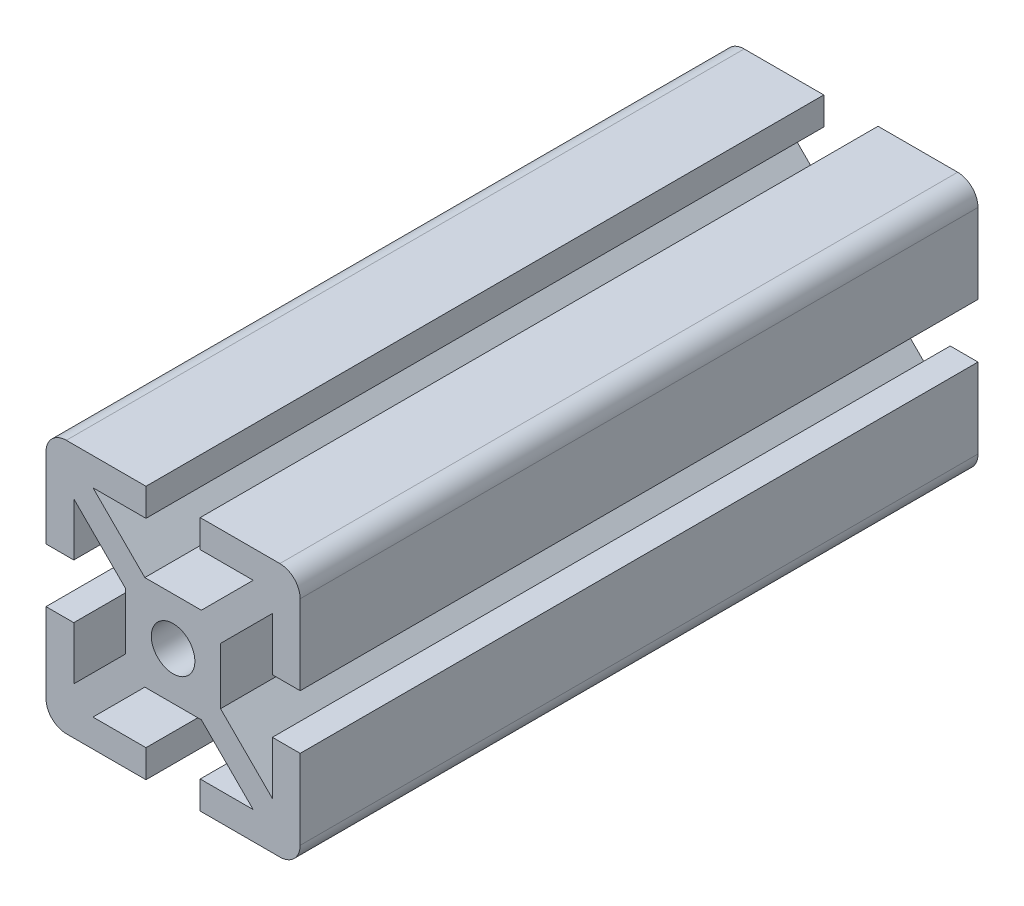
ISO-10303-21;
HEADER;
FILE_DESCRIPTION(('STEP AP214'),'2;1');
FILE_NAME('part.step','',(''),(''),'','','');
FILE_SCHEMA(('AUTOMOTIVE_DESIGN { 1 0 10303 214 1 1 1 1 }'));
ENDSEC;
DATA;
#1=APPLICATION_CONTEXT('core data for automotive mechanical design processes');
#2=APPLICATION_PROTOCOL_DEFINITION('international standard','automotive_design',2000,#1);
#3=PRODUCT_CONTEXT('',#1,'mechanical');
#4=PRODUCT('Part','Part','',(#3));
#5=PRODUCT_RELATED_PRODUCT_CATEGORY('part','',(#4));
#6=PRODUCT_DEFINITION_FORMATION('','',#4);
#7=PRODUCT_DEFINITION_CONTEXT('part definition',#1,'design');
#8=PRODUCT_DEFINITION('design','',#6,#7);
#9=PRODUCT_DEFINITION_SHAPE('','',#8);
#10=(LENGTH_UNIT() NAMED_UNIT(*) SI_UNIT(.MILLI.,.METRE.));
#11=(NAMED_UNIT(*) PLANE_ANGLE_UNIT() SI_UNIT($,.RADIAN.));
#12=(NAMED_UNIT(*) SI_UNIT($,.STERADIAN.) SOLID_ANGLE_UNIT());
#13=UNCERTAINTY_MEASURE_WITH_UNIT(LENGTH_MEASURE(1.E-05),#10,'distance_accuracy_value','');
#14=(GEOMETRIC_REPRESENTATION_CONTEXT(3) GLOBAL_UNCERTAINTY_ASSIGNED_CONTEXT((#13)) GLOBAL_UNIT_ASSIGNED_CONTEXT((#10,
#11,#12)) REPRESENTATION_CONTEXT('',''));
#15=CARTESIAN_POINT('',(0.,0.,0.));
#16=DIRECTION('',(0.,0.,1.));
#17=DIRECTION('',(1.,0.,0.));
#18=AXIS2_PLACEMENT_3D('',#15,#16,#17);
#19=CARTESIAN_POINT('',(-7.11199999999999,0.,-101.6));
#20=DIRECTION('',(-1.,0.,0.));
#21=DIRECTION('',(0.,-1.,0.));
#22=AXIS2_PLACEMENT_3D('',#19,#20,#21);
#23=PLANE('',#22);
#24=DIRECTION('',(0.,-1.,0.));
#25=VECTOR('',#24,1.);
#26=CARTESIAN_POINT('',(-7.11199999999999,0.,0.));
#27=LINE('',#26,#25);
#28=CARTESIAN_POINT('',(-7.11199999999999,4.23831804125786,0.));
#29=VERTEX_POINT('',#28);
#30=CARTESIAN_POINT('',(-7.11199999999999,-4.23831804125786,0.));
#31=VERTEX_POINT('',#30);
#32=EDGE_CURVE('E438',#29,#31,#27,.T.);
#33=ORIENTED_EDGE('',*,*,#32,.F.);
#34=DIRECTION('',(0.,0.,1.));
#35=VECTOR('',#34,1.);
#36=CARTESIAN_POINT('',(-7.11199999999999,4.23831804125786,-101.6));
#37=LINE('',#36,#35);
#38=CARTESIAN_POINT('',(-7.11199999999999,4.23831804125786,-101.6));
#39=VERTEX_POINT('',#38);
#40=EDGE_CURVE('E11',#39,#29,#37,.T.);
#41=ORIENTED_EDGE('',*,*,#40,.F.);
#42=DIRECTION('',(0.,-1.,0.));
#43=VECTOR('',#42,1.);
#44=CARTESIAN_POINT('',(-7.11199999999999,0.,-101.6));
#45=LINE('',#44,#43);
#46=CARTESIAN_POINT('',(-7.11199999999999,-4.23831804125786,-101.6));
#47=VERTEX_POINT('',#46);
#48=EDGE_CURVE('E52',#39,#47,#45,.T.);
#49=ORIENTED_EDGE('',*,*,#48,.T.);
#50=DIRECTION('',(0.,0.,1.));
#51=VECTOR('',#50,1.);
#52=CARTESIAN_POINT('',(-7.11199999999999,-4.23831804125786,-101.6));
#53=LINE('',#52,#51);
#54=EDGE_CURVE('E37',#47,#31,#53,.T.);
#55=ORIENTED_EDGE('',*,*,#54,.T.);
#56=EDGE_LOOP('',(#33,#41,#49,#55));
#57=FACE_BOUND('',#56,.T.);
#58=ADVANCED_FACE('F33',(#57),#23,.T.);
#59=CARTESIAN_POINT('',(-7.11199999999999,4.23831804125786,-101.6));
#60=DIRECTION('',(-0.707106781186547,-0.707106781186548,0.));
#61=DIRECTION('',(0.707106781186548,-0.707106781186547,0.));
#62=AXIS2_PLACEMENT_3D('',#59,#60,#61);
#63=PLANE('',#62);
#64=DIRECTION('',(0.707106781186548,-0.707106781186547,0.));
#65=VECTOR('',#64,1.);
#66=CARTESIAN_POINT('',(-7.11199999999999,4.23831804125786,0.));
#67=LINE('',#66,#65);
#68=CARTESIAN_POINT('',(-14.8844,12.0107180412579,0.));
#69=VERTEX_POINT('',#68);
#70=EDGE_CURVE('E436',#69,#29,#67,.T.);
#71=ORIENTED_EDGE('',*,*,#70,.F.);
#72=DIRECTION('',(0.,0.,1.));
#73=VECTOR('',#72,1.);
#74=CARTESIAN_POINT('',(-14.8844,12.0107180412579,-101.6));
#75=LINE('',#74,#73);
#76=CARTESIAN_POINT('',(-14.8844,12.0107180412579,-101.6));
#77=VERTEX_POINT('',#76);
#78=EDGE_CURVE('E43',#77,#69,#75,.T.);
#79=ORIENTED_EDGE('',*,*,#78,.F.);
#80=DIRECTION('',(0.707106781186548,-0.707106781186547,0.));
#81=VECTOR('',#80,1.);
#82=CARTESIAN_POINT('',(-7.11199999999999,4.23831804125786,-101.6));
#83=LINE('',#82,#81);
#84=EDGE_CURVE('E314',#77,#39,#83,.T.);
#85=ORIENTED_EDGE('',*,*,#84,.T.);
#86=ORIENTED_EDGE('',*,*,#40,.T.);
#87=EDGE_LOOP('',(#71,#79,#85,#86));
#88=FACE_BOUND('',#87,.T.);
#89=ADVANCED_FACE('F518',(#88),#63,.T.);
#90=CARTESIAN_POINT('',(-14.8844,12.0107180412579,-101.6));
#91=DIRECTION('',(1.,0.,0.));
#92=DIRECTION('',(0.,1.,0.));
#93=AXIS2_PLACEMENT_3D('',#90,#91,#92);
#94=PLANE('',#93);
#95=DIRECTION('',(0.,1.,0.));
#96=VECTOR('',#95,1.);
#97=CARTESIAN_POINT('',(-14.8844,12.0107180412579,0.));
#98=LINE('',#97,#96);
#99=CARTESIAN_POINT('',(-14.8844,4.06400000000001,0.));
#100=VERTEX_POINT('',#99);
#101=EDGE_CURVE('E302',#100,#69,#98,.T.);
#102=ORIENTED_EDGE('',*,*,#101,.F.);
#103=DIRECTION('',(0.,0.,1.));
#104=VECTOR('',#103,1.);
#105=CARTESIAN_POINT('',(-14.8844,4.06400000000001,-101.6));
#106=LINE('',#105,#104);
#107=CARTESIAN_POINT('',(-14.8844,4.06400000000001,-101.6));
#108=VERTEX_POINT('',#107);
#109=EDGE_CURVE('E297',#108,#100,#106,.T.);
#110=ORIENTED_EDGE('',*,*,#109,.F.);
#111=DIRECTION('',(0.,1.,0.));
#112=VECTOR('',#111,1.);
#113=CARTESIAN_POINT('',(-14.8844,12.0107180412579,-101.6));
#114=LINE('',#113,#112);
#115=EDGE_CURVE('E300',#108,#77,#114,.T.);
#116=ORIENTED_EDGE('',*,*,#115,.T.);
#117=ORIENTED_EDGE('',*,*,#78,.T.);
#118=EDGE_LOOP('',(#102,#110,#116,#117));
#119=FACE_BOUND('',#118,.T.);
#120=ADVANCED_FACE('F299',(#119),#94,.T.);
#121=CARTESIAN_POINT('',(-14.8844,4.06400000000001,-101.6));
#122=DIRECTION('',(0.,-1.,0.));
#123=DIRECTION('',(1.,0.,0.));
#124=AXIS2_PLACEMENT_3D('',#121,#122,#123);
#125=PLANE('',#124);
#126=DIRECTION('',(1.,0.,0.));
#127=VECTOR('',#126,1.);
#128=CARTESIAN_POINT('',(-14.8844,4.06400000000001,0.));
#129=LINE('',#128,#127);
#130=CARTESIAN_POINT('',(-19.05,4.064,0.));
#131=VERTEX_POINT('',#130);
#132=EDGE_CURVE('E433',#131,#100,#129,.T.);
#133=ORIENTED_EDGE('',*,*,#132,.F.);
#134=DIRECTION('',(0.,0.,1.));
#135=VECTOR('',#134,1.);
#136=CARTESIAN_POINT('',(-19.05,4.064,-101.6));
#137=LINE('',#136,#135);
#138=CARTESIAN_POINT('',(-19.05,4.064,-101.6));
#139=VERTEX_POINT('',#138);
#140=EDGE_CURVE('E307',#139,#131,#137,.T.);
#141=ORIENTED_EDGE('',*,*,#140,.F.);
#142=DIRECTION('',(1.,0.,0.));
#143=VECTOR('',#142,1.);
#144=CARTESIAN_POINT('',(-14.8844,4.06400000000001,-101.6));
#145=LINE('',#144,#143);
#146=EDGE_CURVE('E312',#139,#108,#145,.T.);
#147=ORIENTED_EDGE('',*,*,#146,.T.);
#148=ORIENTED_EDGE('',*,*,#109,.T.);
#149=EDGE_LOOP('',(#133,#141,#147,#148));
#150=FACE_BOUND('',#149,.T.);
#151=ADVANCED_FACE('F316',(#150),#125,.T.);
#152=CARTESIAN_POINT('',(-19.05,4.064,-101.6));
#153=DIRECTION('',(-1.,0.,0.));
#154=DIRECTION('',(0.,-1.,0.));
#155=AXIS2_PLACEMENT_3D('',#152,#153,#154);
#156=PLANE('',#155);
#157=DIRECTION('',(0.,-1.,0.));
#158=VECTOR('',#157,1.);
#159=CARTESIAN_POINT('',(-19.05,4.064,0.));
#160=LINE('',#159,#158);
#161=CARTESIAN_POINT('',(-19.05,16.002,0.));
#162=VERTEX_POINT('',#161);
#163=EDGE_CURVE('E430',#162,#131,#160,.T.);
#164=ORIENTED_EDGE('',*,*,#163,.F.);
#165=DIRECTION('',(0.,0.,1.));
#166=VECTOR('',#165,1.);
#167=CARTESIAN_POINT('',(-19.05,16.002,-101.6));
#168=LINE('',#167,#166);
#169=CARTESIAN_POINT('',(-19.05,16.002,-101.6));
#170=VERTEX_POINT('',#169);
#171=EDGE_CURVE('E442',#170,#162,#168,.T.);
#172=ORIENTED_EDGE('',*,*,#171,.F.);
#173=DIRECTION('',(0.,-1.,0.));
#174=VECTOR('',#173,1.);
#175=CARTESIAN_POINT('',(-19.05,4.064,-101.6));
#176=LINE('',#175,#174);
#177=EDGE_CURVE('E317',#170,#139,#176,.T.);
#178=ORIENTED_EDGE('',*,*,#177,.T.);
#179=ORIENTED_EDGE('',*,*,#140,.T.);
#180=EDGE_LOOP('',(#164,#172,#178,#179));
#181=FACE_BOUND('',#180,.T.);
#182=ADVANCED_FACE('F531',(#181),#156,.T.);
#183=CARTESIAN_POINT('',(-16.002,16.002,-101.6));
#184=DIRECTION('',(0.,0.,1.));
#185=DIRECTION('',(1.,0.,0.));
#186=AXIS2_PLACEMENT_3D('',#183,#184,#185);
#187=CYLINDRICAL_SURFACE('',#186,3.04800000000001);
#188=CARTESIAN_POINT('',(-16.002,16.002,0.));
#189=DIRECTION('',(0.,0.,1.));
#190=DIRECTION('',(1.,0.,0.));
#191=AXIS2_PLACEMENT_3D('',#188,#189,#190);
#192=CIRCLE('',#191,3.04800000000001);
#193=CARTESIAN_POINT('',(-16.002,19.05,0.));
#194=VERTEX_POINT('',#193);
#195=EDGE_CURVE('E427',#194,#162,#192,.T.);
#196=ORIENTED_EDGE('',*,*,#195,.F.);
#197=DIRECTION('',(0.,0.,1.));
#198=VECTOR('',#197,1.);
#199=CARTESIAN_POINT('',(-16.002,19.05,-101.6));
#200=LINE('',#199,#198);
#201=CARTESIAN_POINT('',(-16.002,19.05,-101.6));
#202=VERTEX_POINT('',#201);
#203=EDGE_CURVE('E444',#202,#194,#200,.T.);
#204=ORIENTED_EDGE('',*,*,#203,.F.);
#205=CARTESIAN_POINT('',(-16.002,16.002,-101.6));
#206=DIRECTION('',(0.,0.,1.));
#207=DIRECTION('',(1.,0.,0.));
#208=AXIS2_PLACEMENT_3D('',#205,#206,#207);
#209=CIRCLE('',#208,3.04800000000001);
#210=EDGE_CURVE('E319',#202,#170,#209,.T.);
#211=ORIENTED_EDGE('',*,*,#210,.T.);
#212=ORIENTED_EDGE('',*,*,#171,.T.);
#213=EDGE_LOOP('',(#196,#204,#211,#212));
#214=FACE_BOUND('',#213,.T.);
#215=ADVANCED_FACE('F534',(#214),#187,.T.);
#216=CARTESIAN_POINT('',(-4.06400000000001,19.05,-101.6));
#217=DIRECTION('',(0.,1.,0.));
#218=DIRECTION('',(-1.,0.,0.));
#219=AXIS2_PLACEMENT_3D('',#216,#217,#218);
#220=PLANE('',#219);
#221=DIRECTION('',(-1.,0.,0.));
#222=VECTOR('',#221,1.);
#223=CARTESIAN_POINT('',(-4.06400000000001,19.05,0.));
#224=LINE('',#223,#222);
#225=CARTESIAN_POINT('',(-4.06400000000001,19.05,0.));
#226=VERTEX_POINT('',#225);
#227=EDGE_CURVE('E424',#226,#194,#224,.T.);
#228=ORIENTED_EDGE('',*,*,#227,.F.);
#229=DIRECTION('',(0.,0.,1.));
#230=VECTOR('',#229,1.);
#231=CARTESIAN_POINT('',(-4.06400000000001,19.05,-101.6));
#232=LINE('',#231,#230);
#233=CARTESIAN_POINT('',(-4.06400000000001,19.05,-101.6));
#234=VERTEX_POINT('',#233);
#235=EDGE_CURVE('E446',#234,#226,#232,.T.);
#236=ORIENTED_EDGE('',*,*,#235,.F.);
#237=DIRECTION('',(-1.,0.,0.));
#238=VECTOR('',#237,1.);
#239=CARTESIAN_POINT('',(-4.06400000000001,19.05,-101.6));
#240=LINE('',#239,#238);
#241=EDGE_CURVE('E784',#234,#202,#240,.T.);
#242=ORIENTED_EDGE('',*,*,#241,.T.);
#243=ORIENTED_EDGE('',*,*,#203,.T.);
#244=EDGE_LOOP('',(#228,#236,#242,#243));
#245=FACE_BOUND('',#244,.T.);
#246=ADVANCED_FACE('F538',(#245),#220,.T.);
#247=CARTESIAN_POINT('',(-4.06400000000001,19.05,-101.6));
#248=DIRECTION('',(1.,0.,0.));
#249=DIRECTION('',(0.,1.,0.));
#250=AXIS2_PLACEMENT_3D('',#247,#248,#249);
#251=PLANE('',#250);
#252=DIRECTION('',(0.,1.,0.));
#253=VECTOR('',#252,1.);
#254=CARTESIAN_POINT('',(-4.06400000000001,19.05,0.));
#255=LINE('',#254,#253);
#256=CARTESIAN_POINT('',(-4.064,14.8844,0.));
#257=VERTEX_POINT('',#256);
#258=EDGE_CURVE('E421',#257,#226,#255,.T.);
#259=ORIENTED_EDGE('',*,*,#258,.F.);
#260=DIRECTION('',(0.,0.,1.));
#261=VECTOR('',#260,1.);
#262=CARTESIAN_POINT('',(-4.064,14.8844,-101.6));
#263=LINE('',#262,#261);
#264=CARTESIAN_POINT('',(-4.064,14.8844,-101.6));
#265=VERTEX_POINT('',#264);
#266=EDGE_CURVE('E448',#265,#257,#263,.T.);
#267=ORIENTED_EDGE('',*,*,#266,.F.);
#268=DIRECTION('',(0.,1.,0.));
#269=VECTOR('',#268,1.);
#270=CARTESIAN_POINT('',(-4.06400000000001,19.05,-101.6));
#271=LINE('',#270,#269);
#272=EDGE_CURVE('E781',#265,#234,#271,.T.);
#273=ORIENTED_EDGE('',*,*,#272,.T.);
#274=ORIENTED_EDGE('',*,*,#235,.T.);
#275=EDGE_LOOP('',(#259,#267,#273,#274));
#276=FACE_BOUND('',#275,.T.);
#277=ADVANCED_FACE('F542',(#276),#251,.T.);
#278=CARTESIAN_POINT('',(-12.0107180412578,14.8844,-101.6));
#279=DIRECTION('',(0.,-1.,0.));
#280=DIRECTION('',(1.,0.,0.));
#281=AXIS2_PLACEMENT_3D('',#278,#279,#280);
#282=PLANE('',#281);
#283=DIRECTION('',(1.,0.,0.));
#284=VECTOR('',#283,1.);
#285=CARTESIAN_POINT('',(-12.0107180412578,14.8844,0.));
#286=LINE('',#285,#284);
#287=CARTESIAN_POINT('',(-12.0107180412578,14.8844,0.));
#288=VERTEX_POINT('',#287);
#289=EDGE_CURVE('E418',#288,#257,#286,.T.);
#290=ORIENTED_EDGE('',*,*,#289,.F.);
#291=DIRECTION('',(0.,0.,1.));
#292=VECTOR('',#291,1.);
#293=CARTESIAN_POINT('',(-12.0107180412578,14.8844,-101.6));
#294=LINE('',#293,#292);
#295=CARTESIAN_POINT('',(-12.0107180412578,14.8844,-101.6));
#296=VERTEX_POINT('',#295);
#297=EDGE_CURVE('E450',#296,#288,#294,.T.);
#298=ORIENTED_EDGE('',*,*,#297,.F.);
#299=DIRECTION('',(1.,0.,0.));
#300=VECTOR('',#299,1.);
#301=CARTESIAN_POINT('',(-12.0107180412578,14.8844,-101.6));
#302=LINE('',#301,#300);
#303=EDGE_CURVE('E778',#296,#265,#302,.T.);
#304=ORIENTED_EDGE('',*,*,#303,.T.);
#305=ORIENTED_EDGE('',*,*,#266,.T.);
#306=EDGE_LOOP('',(#290,#298,#304,#305));
#307=FACE_BOUND('',#306,.T.);
#308=ADVANCED_FACE('F546',(#307),#282,.T.);
#309=CARTESIAN_POINT('',(-4.23831804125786,7.112,-101.6));
#310=DIRECTION('',(0.707106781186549,0.707106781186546,0.));
#311=DIRECTION('',(-0.707106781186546,0.707106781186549,0.));
#312=AXIS2_PLACEMENT_3D('',#309,#310,#311);
#313=PLANE('',#312);
#314=DIRECTION('',(-0.707106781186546,0.707106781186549,0.));
#315=VECTOR('',#314,1.);
#316=CARTESIAN_POINT('',(-4.23831804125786,7.112,0.));
#317=LINE('',#316,#315);
#318=CARTESIAN_POINT('',(-4.23831804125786,7.112,0.));
#319=VERTEX_POINT('',#318);
#320=EDGE_CURVE('E415',#319,#288,#317,.T.);
#321=ORIENTED_EDGE('',*,*,#320,.F.);
#322=DIRECTION('',(0.,0.,1.));
#323=VECTOR('',#322,1.);
#324=CARTESIAN_POINT('',(-4.23831804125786,7.112,-101.6));
#325=LINE('',#324,#323);
#326=CARTESIAN_POINT('',(-4.23831804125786,7.112,-101.6));
#327=VERTEX_POINT('',#326);
#328=EDGE_CURVE('E452',#327,#319,#325,.T.);
#329=ORIENTED_EDGE('',*,*,#328,.F.);
#330=DIRECTION('',(-0.707106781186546,0.707106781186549,0.));
#331=VECTOR('',#330,1.);
#332=CARTESIAN_POINT('',(-4.23831804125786,7.112,-101.6));
#333=LINE('',#332,#331);
#334=EDGE_CURVE('E775',#327,#296,#333,.T.);
#335=ORIENTED_EDGE('',*,*,#334,.T.);
#336=ORIENTED_EDGE('',*,*,#297,.T.);
#337=EDGE_LOOP('',(#321,#329,#335,#336));
#338=FACE_BOUND('',#337,.T.);
#339=ADVANCED_FACE('F550',(#338),#313,.T.);
#340=CARTESIAN_POINT('',(0.,7.112,-101.6));
#341=DIRECTION('',(0.,1.,0.));
#342=DIRECTION('',(-1.,0.,0.));
#343=AXIS2_PLACEMENT_3D('',#340,#341,#342);
#344=PLANE('',#343);
#345=DIRECTION('',(-1.,0.,0.));
#346=VECTOR('',#345,1.);
#347=CARTESIAN_POINT('',(0.,7.112,0.));
#348=LINE('',#347,#346);
#349=CARTESIAN_POINT('',(4.23831804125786,7.112,0.));
#350=VERTEX_POINT('',#349);
#351=EDGE_CURVE('E412',#350,#319,#348,.T.);
#352=ORIENTED_EDGE('',*,*,#351,.F.);
#353=DIRECTION('',(0.,0.,1.));
#354=VECTOR('',#353,1.);
#355=CARTESIAN_POINT('',(4.23831804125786,7.112,-101.6));
#356=LINE('',#355,#354);
#357=CARTESIAN_POINT('',(4.23831804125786,7.112,-101.6));
#358=VERTEX_POINT('',#357);
#359=EDGE_CURVE('E454',#358,#350,#356,.T.);
#360=ORIENTED_EDGE('',*,*,#359,.F.);
#361=DIRECTION('',(-1.,0.,0.));
#362=VECTOR('',#361,1.);
#363=CARTESIAN_POINT('',(0.,7.112,-101.6));
#364=LINE('',#363,#362);
#365=EDGE_CURVE('E773',#358,#327,#364,.T.);
#366=ORIENTED_EDGE('',*,*,#365,.T.);
#367=ORIENTED_EDGE('',*,*,#328,.T.);
#368=EDGE_LOOP('',(#352,#360,#366,#367));
#369=FACE_BOUND('',#368,.T.);
#370=ADVANCED_FACE('F554',(#369),#344,.T.);
#371=CARTESIAN_POINT('',(4.23831804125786,7.112,-101.6));
#372=DIRECTION('',(-0.707106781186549,0.707106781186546,0.));
#373=DIRECTION('',(-0.707106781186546,-0.707106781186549,0.));
#374=AXIS2_PLACEMENT_3D('',#371,#372,#373);
#375=PLANE('',#374);
#376=DIRECTION('',(-0.707106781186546,-0.707106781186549,0.));
#377=VECTOR('',#376,1.);
#378=CARTESIAN_POINT('',(4.23831804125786,7.112,0.));
#379=LINE('',#378,#377);
#380=CARTESIAN_POINT('',(12.0107180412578,14.8844,0.));
#381=VERTEX_POINT('',#380);
#382=EDGE_CURVE('E409',#381,#350,#379,.T.);
#383=ORIENTED_EDGE('',*,*,#382,.F.);
#384=DIRECTION('',(0.,0.,1.));
#385=VECTOR('',#384,1.);
#386=CARTESIAN_POINT('',(12.0107180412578,14.8844,-101.6));
#387=LINE('',#386,#385);
#388=CARTESIAN_POINT('',(12.0107180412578,14.8844,-101.6));
#389=VERTEX_POINT('',#388);
#390=EDGE_CURVE('E457',#389,#381,#387,.T.);
#391=ORIENTED_EDGE('',*,*,#390,.F.);
#392=DIRECTION('',(-0.707106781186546,-0.707106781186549,0.));
#393=VECTOR('',#392,1.);
#394=CARTESIAN_POINT('',(4.23831804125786,7.112,-101.6));
#395=LINE('',#394,#393);
#396=EDGE_CURVE('E770',#389,#358,#395,.T.);
#397=ORIENTED_EDGE('',*,*,#396,.T.);
#398=ORIENTED_EDGE('',*,*,#359,.T.);
#399=EDGE_LOOP('',(#383,#391,#397,#398));
#400=FACE_BOUND('',#399,.T.);
#401=ADVANCED_FACE('F558',(#400),#375,.T.);
#402=CARTESIAN_POINT('',(12.0107180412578,14.8844,-101.6));
#403=DIRECTION('',(0.,-1.,0.));
#404=DIRECTION('',(1.,0.,0.));
#405=AXIS2_PLACEMENT_3D('',#402,#403,#404);
#406=PLANE('',#405);
#407=DIRECTION('',(1.,0.,0.));
#408=VECTOR('',#407,1.);
#409=CARTESIAN_POINT('',(12.0107180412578,14.8844,0.));
#410=LINE('',#409,#408);
#411=CARTESIAN_POINT('',(4.064,14.8844,0.));
#412=VERTEX_POINT('',#411);
#413=EDGE_CURVE('E406',#412,#381,#410,.T.);
#414=ORIENTED_EDGE('',*,*,#413,.F.);
#415=DIRECTION('',(0.,0.,1.));
#416=VECTOR('',#415,1.);
#417=CARTESIAN_POINT('',(4.064,14.8844,-101.6));
#418=LINE('',#417,#416);
#419=CARTESIAN_POINT('',(4.064,14.8844,-101.6));
#420=VERTEX_POINT('',#419);
#421=EDGE_CURVE('E459',#420,#412,#418,.T.);
#422=ORIENTED_EDGE('',*,*,#421,.F.);
#423=DIRECTION('',(1.,0.,0.));
#424=VECTOR('',#423,1.);
#425=CARTESIAN_POINT('',(12.0107180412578,14.8844,-101.6));
#426=LINE('',#425,#424);
#427=EDGE_CURVE('E767',#420,#389,#426,.T.);
#428=ORIENTED_EDGE('',*,*,#427,.T.);
#429=ORIENTED_EDGE('',*,*,#390,.T.);
#430=EDGE_LOOP('',(#414,#422,#428,#429));
#431=FACE_BOUND('',#430,.T.);
#432=ADVANCED_FACE('F562',(#431),#406,.T.);
#433=CARTESIAN_POINT('',(4.06400000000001,19.05,-101.6));
#434=DIRECTION('',(-1.,0.,0.));
#435=DIRECTION('',(0.,-1.,0.));
#436=AXIS2_PLACEMENT_3D('',#433,#434,#435);
#437=PLANE('',#436);
#438=DIRECTION('',(0.,-1.,0.));
#439=VECTOR('',#438,1.);
#440=CARTESIAN_POINT('',(4.06400000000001,19.05,0.));
#441=LINE('',#440,#439);
#442=CARTESIAN_POINT('',(4.06400000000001,19.05,0.));
#443=VERTEX_POINT('',#442);
#444=EDGE_CURVE('E403',#443,#412,#441,.T.);
#445=ORIENTED_EDGE('',*,*,#444,.F.);
#446=DIRECTION('',(0.,0.,1.));
#447=VECTOR('',#446,1.);
#448=CARTESIAN_POINT('',(4.06400000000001,19.05,-101.6));
#449=LINE('',#448,#447);
#450=CARTESIAN_POINT('',(4.06400000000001,19.05,-101.6));
#451=VERTEX_POINT('',#450);
#452=EDGE_CURVE('E461',#451,#443,#449,.T.);
#453=ORIENTED_EDGE('',*,*,#452,.F.);
#454=DIRECTION('',(0.,-1.,0.));
#455=VECTOR('',#454,1.);
#456=CARTESIAN_POINT('',(4.06400000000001,19.05,-101.6));
#457=LINE('',#456,#455);
#458=EDGE_CURVE('E764',#451,#420,#457,.T.);
#459=ORIENTED_EDGE('',*,*,#458,.T.);
#460=ORIENTED_EDGE('',*,*,#421,.T.);
#461=EDGE_LOOP('',(#445,#453,#459,#460));
#462=FACE_BOUND('',#461,.T.);
#463=ADVANCED_FACE('F566',(#462),#437,.T.);
#464=CARTESIAN_POINT('',(4.06400000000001,19.05,-101.6));
#465=DIRECTION('',(0.,1.,0.));
#466=DIRECTION('',(-1.,0.,0.));
#467=AXIS2_PLACEMENT_3D('',#464,#465,#466);
#468=PLANE('',#467);
#469=DIRECTION('',(-1.,0.,0.));
#470=VECTOR('',#469,1.);
#471=CARTESIAN_POINT('',(4.06400000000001,19.05,0.));
#472=LINE('',#471,#470);
#473=CARTESIAN_POINT('',(16.002,19.05,0.));
#474=VERTEX_POINT('',#473);
#475=EDGE_CURVE('E400',#474,#443,#472,.T.);
#476=ORIENTED_EDGE('',*,*,#475,.F.);
#477=DIRECTION('',(0.,0.,1.));
#478=VECTOR('',#477,1.);
#479=CARTESIAN_POINT('',(16.002,19.05,-101.6));
#480=LINE('',#479,#478);
#481=CARTESIAN_POINT('',(16.002,19.05,-101.6));
#482=VERTEX_POINT('',#481);
#483=EDGE_CURVE('E463',#482,#474,#480,.T.);
#484=ORIENTED_EDGE('',*,*,#483,.F.);
#485=DIRECTION('',(-1.,0.,0.));
#486=VECTOR('',#485,1.);
#487=CARTESIAN_POINT('',(4.06400000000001,19.05,-101.6));
#488=LINE('',#487,#486);
#489=EDGE_CURVE('E761',#482,#451,#488,.T.);
#490=ORIENTED_EDGE('',*,*,#489,.T.);
#491=ORIENTED_EDGE('',*,*,#452,.T.);
#492=EDGE_LOOP('',(#476,#484,#490,#491));
#493=FACE_BOUND('',#492,.T.);
#494=ADVANCED_FACE('F570',(#493),#468,.T.);
#495=CARTESIAN_POINT('',(16.002,16.002,-101.6));
#496=DIRECTION('',(0.,0.,1.));
#497=DIRECTION('',(1.,0.,0.));
#498=AXIS2_PLACEMENT_3D('',#495,#496,#497);
#499=CYLINDRICAL_SURFACE('',#498,3.04800000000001);
#500=CARTESIAN_POINT('',(16.002,16.002,0.));
#501=DIRECTION('',(0.,0.,1.));
#502=DIRECTION('',(-1.,0.,0.));
#503=AXIS2_PLACEMENT_3D('',#500,#501,#502);
#504=CIRCLE('',#503,3.04800000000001);
#505=CARTESIAN_POINT('',(19.05,16.002,0.));
#506=VERTEX_POINT('',#505);
#507=EDGE_CURVE('E397',#506,#474,#504,.T.);
#508=ORIENTED_EDGE('',*,*,#507,.F.);
#509=DIRECTION('',(0.,0.,1.));
#510=VECTOR('',#509,1.);
#511=CARTESIAN_POINT('',(19.05,16.002,-101.6));
#512=LINE('',#511,#510);
#513=CARTESIAN_POINT('',(19.05,16.002,-101.6));
#514=VERTEX_POINT('',#513);
#515=EDGE_CURVE('E465',#514,#506,#512,.T.);
#516=ORIENTED_EDGE('',*,*,#515,.F.);
#517=CARTESIAN_POINT('',(16.002,16.002,-101.6));
#518=DIRECTION('',(0.,0.,1.));
#519=DIRECTION('',(-1.,0.,0.));
#520=AXIS2_PLACEMENT_3D('',#517,#518,#519);
#521=CIRCLE('',#520,3.04800000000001);
#522=EDGE_CURVE('E758',#514,#482,#521,.T.);
#523=ORIENTED_EDGE('',*,*,#522,.T.);
#524=ORIENTED_EDGE('',*,*,#483,.T.);
#525=EDGE_LOOP('',(#508,#516,#523,#524));
#526=FACE_BOUND('',#525,.T.);
#527=ADVANCED_FACE('F574',(#526),#499,.T.);
#528=CARTESIAN_POINT('',(19.05,4.064,-101.6));
#529=DIRECTION('',(1.,0.,0.));
#530=DIRECTION('',(0.,1.,0.));
#531=AXIS2_PLACEMENT_3D('',#528,#529,#530);
#532=PLANE('',#531);
#533=DIRECTION('',(0.,1.,0.));
#534=VECTOR('',#533,1.);
#535=CARTESIAN_POINT('',(19.05,4.064,0.));
#536=LINE('',#535,#534);
#537=CARTESIAN_POINT('',(19.05,4.064,0.));
#538=VERTEX_POINT('',#537);
#539=EDGE_CURVE('E394',#538,#506,#536,.T.);
#540=ORIENTED_EDGE('',*,*,#539,.F.);
#541=DIRECTION('',(0.,0.,1.));
#542=VECTOR('',#541,1.);
#543=CARTESIAN_POINT('',(19.05,4.064,-101.6));
#544=LINE('',#543,#542);
#545=CARTESIAN_POINT('',(19.05,4.064,-101.6));
#546=VERTEX_POINT('',#545);
#547=EDGE_CURVE('E467',#546,#538,#544,.T.);
#548=ORIENTED_EDGE('',*,*,#547,.F.);
#549=DIRECTION('',(0.,1.,0.));
#550=VECTOR('',#549,1.);
#551=CARTESIAN_POINT('',(19.05,4.064,-101.6));
#552=LINE('',#551,#550);
#553=EDGE_CURVE('E755',#546,#514,#552,.T.);
#554=ORIENTED_EDGE('',*,*,#553,.T.);
#555=ORIENTED_EDGE('',*,*,#515,.T.);
#556=EDGE_LOOP('',(#540,#548,#554,#555));
#557=FACE_BOUND('',#556,.T.);
#558=ADVANCED_FACE('F578',(#557),#532,.T.);
#559=CARTESIAN_POINT('',(14.8844,4.06400000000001,-101.6));
#560=DIRECTION('',(0.,-1.,0.));
#561=DIRECTION('',(1.,0.,0.));
#562=AXIS2_PLACEMENT_3D('',#559,#560,#561);
#563=PLANE('',#562);
#564=DIRECTION('',(1.,0.,0.));
#565=VECTOR('',#564,1.);
#566=CARTESIAN_POINT('',(14.8844,4.06400000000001,0.));
#567=LINE('',#566,#565);
#568=CARTESIAN_POINT('',(14.8844,4.06400000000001,0.));
#569=VERTEX_POINT('',#568);
#570=EDGE_CURVE('E391',#569,#538,#567,.T.);
#571=ORIENTED_EDGE('',*,*,#570,.F.);
#572=DIRECTION('',(0.,0.,1.));
#573=VECTOR('',#572,1.);
#574=CARTESIAN_POINT('',(14.8844,4.06400000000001,-101.6));
#575=LINE('',#574,#573);
#576=CARTESIAN_POINT('',(14.8844,4.06400000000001,-101.6));
#577=VERTEX_POINT('',#576);
#578=EDGE_CURVE('E469',#577,#569,#575,.T.);
#579=ORIENTED_EDGE('',*,*,#578,.F.);
#580=DIRECTION('',(1.,0.,0.));
#581=VECTOR('',#580,1.);
#582=CARTESIAN_POINT('',(14.8844,4.06400000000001,-101.6));
#583=LINE('',#582,#581);
#584=EDGE_CURVE('E752',#577,#546,#583,.T.);
#585=ORIENTED_EDGE('',*,*,#584,.T.);
#586=ORIENTED_EDGE('',*,*,#547,.T.);
#587=EDGE_LOOP('',(#571,#579,#585,#586));
#588=FACE_BOUND('',#587,.T.);
#589=ADVANCED_FACE('F582',(#588),#563,.T.);
#590=CARTESIAN_POINT('',(14.8844,12.0107180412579,-101.6));
#591=DIRECTION('',(-1.,0.,0.));
#592=DIRECTION('',(0.,-1.,0.));
#593=AXIS2_PLACEMENT_3D('',#590,#591,#592);
#594=PLANE('',#593);
#595=DIRECTION('',(0.,-1.,0.));
#596=VECTOR('',#595,1.);
#597=CARTESIAN_POINT('',(14.8844,12.0107180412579,0.));
#598=LINE('',#597,#596);
#599=CARTESIAN_POINT('',(14.8844,12.0107180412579,0.));
#600=VERTEX_POINT('',#599);
#601=EDGE_CURVE('E388',#600,#569,#598,.T.);
#602=ORIENTED_EDGE('',*,*,#601,.F.);
#603=DIRECTION('',(0.,0.,1.));
#604=VECTOR('',#603,1.);
#605=CARTESIAN_POINT('',(14.8844,12.0107180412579,-101.6));
#606=LINE('',#605,#604);
#607=CARTESIAN_POINT('',(14.8844,12.0107180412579,-101.6));
#608=VERTEX_POINT('',#607);
#609=EDGE_CURVE('E471',#608,#600,#606,.T.);
#610=ORIENTED_EDGE('',*,*,#609,.F.);
#611=DIRECTION('',(0.,-1.,0.));
#612=VECTOR('',#611,1.);
#613=CARTESIAN_POINT('',(14.8844,12.0107180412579,-101.6));
#614=LINE('',#613,#612);
#615=EDGE_CURVE('E744',#608,#577,#614,.T.);
#616=ORIENTED_EDGE('',*,*,#615,.T.);
#617=ORIENTED_EDGE('',*,*,#578,.T.);
#618=EDGE_LOOP('',(#602,#610,#616,#617));
#619=FACE_BOUND('',#618,.T.);
#620=ADVANCED_FACE('F586',(#619),#594,.T.);
#621=CARTESIAN_POINT('',(7.11199999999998,4.23831804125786,-101.6));
#622=DIRECTION('',(0.707106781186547,-0.707106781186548,0.));
#623=DIRECTION('',(0.707106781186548,0.707106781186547,0.));
#624=AXIS2_PLACEMENT_3D('',#621,#622,#623);
#625=PLANE('',#624);
#626=DIRECTION('',(0.707106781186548,0.707106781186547,0.));
#627=VECTOR('',#626,1.);
#628=CARTESIAN_POINT('',(7.11199999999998,4.23831804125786,0.));
#629=LINE('',#628,#627);
#630=CARTESIAN_POINT('',(7.11199999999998,4.23831804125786,0.));
#631=VERTEX_POINT('',#630);
#632=EDGE_CURVE('E385',#631,#600,#629,.T.);
#633=ORIENTED_EDGE('',*,*,#632,.F.);
#634=DIRECTION('',(0.,0.,1.));
#635=VECTOR('',#634,1.);
#636=CARTESIAN_POINT('',(7.11199999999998,4.23831804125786,-101.6));
#637=LINE('',#636,#635);
#638=CARTESIAN_POINT('',(7.11199999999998,4.23831804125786,-101.6));
#639=VERTEX_POINT('',#638);
#640=EDGE_CURVE('E473',#639,#631,#637,.T.);
#641=ORIENTED_EDGE('',*,*,#640,.F.);
#642=DIRECTION('',(0.707106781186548,0.707106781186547,0.));
#643=VECTOR('',#642,1.);
#644=CARTESIAN_POINT('',(7.11199999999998,4.23831804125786,-101.6));
#645=LINE('',#644,#643);
#646=EDGE_CURVE('E742',#639,#608,#645,.T.);
#647=ORIENTED_EDGE('',*,*,#646,.T.);
#648=ORIENTED_EDGE('',*,*,#609,.T.);
#649=EDGE_LOOP('',(#633,#641,#647,#648));
#650=FACE_BOUND('',#649,.T.);
#651=ADVANCED_FACE('F590',(#650),#625,.T.);
#652=CARTESIAN_POINT('',(7.11199999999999,0.,-101.6));
#653=DIRECTION('',(1.,0.,0.));
#654=DIRECTION('',(0.,1.,0.));
#655=AXIS2_PLACEMENT_3D('',#652,#653,#654);
#656=PLANE('',#655);
#657=DIRECTION('',(0.,1.,0.));
#658=VECTOR('',#657,1.);
#659=CARTESIAN_POINT('',(7.11199999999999,0.,0.));
#660=LINE('',#659,#658);
#661=CARTESIAN_POINT('',(7.11199999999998,-4.23831804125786,0.));
#662=VERTEX_POINT('',#661);
#663=EDGE_CURVE('E382',#662,#631,#660,.T.);
#664=ORIENTED_EDGE('',*,*,#663,.F.);
#665=DIRECTION('',(0.,0.,1.));
#666=VECTOR('',#665,1.);
#667=CARTESIAN_POINT('',(7.11199999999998,-4.23831804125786,-101.6));
#668=LINE('',#667,#666);
#669=CARTESIAN_POINT('',(7.11199999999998,-4.23831804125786,-101.6));
#670=VERTEX_POINT('',#669);
#671=EDGE_CURVE('E475',#670,#662,#668,.T.);
#672=ORIENTED_EDGE('',*,*,#671,.F.);
#673=DIRECTION('',(0.,1.,0.));
#674=VECTOR('',#673,1.);
#675=CARTESIAN_POINT('',(7.11199999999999,0.,-101.6));
#676=LINE('',#675,#674);
#677=EDGE_CURVE('E737',#670,#639,#676,.T.);
#678=ORIENTED_EDGE('',*,*,#677,.T.);
#679=ORIENTED_EDGE('',*,*,#640,.T.);
#680=EDGE_LOOP('',(#664,#672,#678,#679));
#681=FACE_BOUND('',#680,.T.);
#682=ADVANCED_FACE('F594',(#681),#656,.T.);
#683=CARTESIAN_POINT('',(7.11199999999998,-4.23831804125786,-101.6));
#684=DIRECTION('',(0.707106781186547,0.707106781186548,0.));
#685=DIRECTION('',(-0.707106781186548,0.707106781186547,0.));
#686=AXIS2_PLACEMENT_3D('',#683,#684,#685);
#687=PLANE('',#686);
#688=DIRECTION('',(-0.707106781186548,0.707106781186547,0.));
#689=VECTOR('',#688,1.);
#690=CARTESIAN_POINT('',(7.11199999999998,-4.23831804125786,0.));
#691=LINE('',#690,#689);
#692=CARTESIAN_POINT('',(14.8844,-12.0107180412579,0.));
#693=VERTEX_POINT('',#692);
#694=EDGE_CURVE('E379',#693,#662,#691,.T.);
#695=ORIENTED_EDGE('',*,*,#694,.F.);
#696=DIRECTION('',(0.,0.,1.));
#697=VECTOR('',#696,1.);
#698=CARTESIAN_POINT('',(14.8844,-12.0107180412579,-101.6));
#699=LINE('',#698,#697);
#700=CARTESIAN_POINT('',(14.8844,-12.0107180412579,-101.6));
#701=VERTEX_POINT('',#700);
#702=EDGE_CURVE('E478',#701,#693,#699,.T.);
#703=ORIENTED_EDGE('',*,*,#702,.F.);
#704=DIRECTION('',(-0.707106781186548,0.707106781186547,0.));
#705=VECTOR('',#704,1.);
#706=CARTESIAN_POINT('',(7.11199999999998,-4.23831804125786,-101.6));
#707=LINE('',#706,#705);
#708=EDGE_CURVE('E735',#701,#670,#707,.T.);
#709=ORIENTED_EDGE('',*,*,#708,.T.);
#710=ORIENTED_EDGE('',*,*,#671,.T.);
#711=EDGE_LOOP('',(#695,#703,#709,#710));
#712=FACE_BOUND('',#711,.T.);
#713=ADVANCED_FACE('F598',(#712),#687,.T.);
#714=CARTESIAN_POINT('',(14.8844,-12.0107180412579,-101.6));
#715=DIRECTION('',(-1.,0.,0.));
#716=DIRECTION('',(0.,-1.,0.));
#717=AXIS2_PLACEMENT_3D('',#714,#715,#716);
#718=PLANE('',#717);
#719=DIRECTION('',(0.,-1.,0.));
#720=VECTOR('',#719,1.);
#721=CARTESIAN_POINT('',(14.8844,-12.0107180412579,0.));
#722=LINE('',#721,#720);
#723=CARTESIAN_POINT('',(14.8844,-4.06400000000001,0.));
#724=VERTEX_POINT('',#723);
#725=EDGE_CURVE('E376',#724,#693,#722,.T.);
#726=ORIENTED_EDGE('',*,*,#725,.F.);
#727=DIRECTION('',(0.,0.,1.));
#728=VECTOR('',#727,1.);
#729=CARTESIAN_POINT('',(14.8844,-4.06400000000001,-101.6));
#730=LINE('',#729,#728);
#731=CARTESIAN_POINT('',(14.8844,-4.06400000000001,-101.6));
#732=VERTEX_POINT('',#731);
#733=EDGE_CURVE('E480',#732,#724,#730,.T.);
#734=ORIENTED_EDGE('',*,*,#733,.F.);
#735=DIRECTION('',(0.,-1.,0.));
#736=VECTOR('',#735,1.);
#737=CARTESIAN_POINT('',(14.8844,-12.0107180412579,-101.6));
#738=LINE('',#737,#736);
#739=EDGE_CURVE('E746',#732,#701,#738,.T.);
#740=ORIENTED_EDGE('',*,*,#739,.T.);
#741=ORIENTED_EDGE('',*,*,#702,.T.);
#742=EDGE_LOOP('',(#726,#734,#740,#741));
#743=FACE_BOUND('',#742,.T.);
#744=ADVANCED_FACE('F602',(#743),#718,.T.);
#745=CARTESIAN_POINT('',(14.8844,-4.06400000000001,-101.6));
#746=DIRECTION('',(0.,1.,0.));
#747=DIRECTION('',(-1.,0.,0.));
#748=AXIS2_PLACEMENT_3D('',#745,#746,#747);
#749=PLANE('',#748);
#750=DIRECTION('',(-1.,0.,0.));
#751=VECTOR('',#750,1.);
#752=CARTESIAN_POINT('',(14.8844,-4.06400000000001,0.));
#753=LINE('',#752,#751);
#754=CARTESIAN_POINT('',(19.05,-4.06399999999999,0.));
#755=VERTEX_POINT('',#754);
#756=EDGE_CURVE('E373',#755,#724,#753,.T.);
#757=ORIENTED_EDGE('',*,*,#756,.F.);
#758=DIRECTION('',(0.,0.,1.));
#759=VECTOR('',#758,1.);
#760=CARTESIAN_POINT('',(19.05,-4.06399999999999,-101.6));
#761=LINE('',#760,#759);
#762=CARTESIAN_POINT('',(19.05,-4.06399999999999,-101.6));
#763=VERTEX_POINT('',#762);
#764=EDGE_CURVE('E482',#763,#755,#761,.T.);
#765=ORIENTED_EDGE('',*,*,#764,.F.);
#766=DIRECTION('',(-1.,0.,0.));
#767=VECTOR('',#766,1.);
#768=CARTESIAN_POINT('',(14.8844,-4.06400000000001,-101.6));
#769=LINE('',#768,#767);
#770=EDGE_CURVE('E729',#763,#732,#769,.T.);
#771=ORIENTED_EDGE('',*,*,#770,.T.);
#772=ORIENTED_EDGE('',*,*,#733,.T.);
#773=EDGE_LOOP('',(#757,#765,#771,#772));
#774=FACE_BOUND('',#773,.T.);
#775=ADVANCED_FACE('F606',(#774),#749,.T.);
#776=CARTESIAN_POINT('',(19.05,-4.06399999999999,-101.6));
#777=DIRECTION('',(1.,0.,0.));
#778=DIRECTION('',(0.,0.,-1.));
#779=AXIS2_PLACEMENT_3D('',#776,#777,#778);
#780=PLANE('',#779);
#781=DIRECTION('',(0.,1.,0.));
#782=VECTOR('',#781,1.);
#783=CARTESIAN_POINT('',(19.05,-4.06399999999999,0.));
#784=LINE('',#783,#782);
#785=CARTESIAN_POINT('',(19.05,-16.002,0.));
#786=VERTEX_POINT('',#785);
#787=EDGE_CURVE('E370',#786,#755,#784,.T.);
#788=ORIENTED_EDGE('',*,*,#787,.F.);
#789=DIRECTION('',(0.,0.,1.));
#790=VECTOR('',#789,1.);
#791=CARTESIAN_POINT('',(19.05,-16.002,-101.6));
#792=LINE('',#791,#790);
#793=CARTESIAN_POINT('',(19.05,-16.002,-101.6));
#794=VERTEX_POINT('',#793);
#795=EDGE_CURVE('E484',#794,#786,#792,.T.);
#796=ORIENTED_EDGE('',*,*,#795,.F.);
#797=DIRECTION('',(0.,1.,0.));
#798=VECTOR('',#797,1.);
#799=CARTESIAN_POINT('',(19.05,-4.06399999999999,-101.6));
#800=LINE('',#799,#798);
#801=EDGE_CURVE('E725',#794,#763,#800,.T.);
#802=ORIENTED_EDGE('',*,*,#801,.T.);
#803=ORIENTED_EDGE('',*,*,#764,.T.);
#804=EDGE_LOOP('',(#788,#796,#802,#803));
#805=FACE_BOUND('',#804,.T.);
#806=ADVANCED_FACE('F610',(#805),#780,.T.);
#807=CARTESIAN_POINT('',(16.002,-16.002,-101.6));
#808=DIRECTION('',(0.,0.,1.));
#809=DIRECTION('',(1.,0.,0.));
#810=AXIS2_PLACEMENT_3D('',#807,#808,#809);
#811=CYLINDRICAL_SURFACE('',#810,3.04800000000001);
#812=CARTESIAN_POINT('',(16.002,-16.002,0.));
#813=DIRECTION('',(0.,0.,1.));
#814=DIRECTION('',(1.,0.,0.));
#815=AXIS2_PLACEMENT_3D('',#812,#813,#814);
#816=CIRCLE('',#815,3.04800000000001);
#817=CARTESIAN_POINT('',(16.002,-19.05,0.));
#818=VERTEX_POINT('',#817);
#819=EDGE_CURVE('E367',#818,#786,#816,.T.);
#820=ORIENTED_EDGE('',*,*,#819,.F.);
#821=DIRECTION('',(0.,0.,1.));
#822=VECTOR('',#821,1.);
#823=CARTESIAN_POINT('',(16.002,-19.05,-101.6));
#824=LINE('',#823,#822);
#825=CARTESIAN_POINT('',(16.002,-19.05,-101.6));
#826=VERTEX_POINT('',#825);
#827=EDGE_CURVE('E486',#826,#818,#824,.T.);
#828=ORIENTED_EDGE('',*,*,#827,.F.);
#829=CARTESIAN_POINT('',(16.002,-16.002,-101.6));
#830=DIRECTION('',(0.,0.,1.));
#831=DIRECTION('',(1.,0.,0.));
#832=AXIS2_PLACEMENT_3D('',#829,#830,#831);
#833=CIRCLE('',#832,3.04800000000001);
#834=EDGE_CURVE('E819',#826,#794,#833,.T.);
#835=ORIENTED_EDGE('',*,*,#834,.T.);
#836=ORIENTED_EDGE('',*,*,#795,.T.);
#837=EDGE_LOOP('',(#820,#828,#835,#836));
#838=FACE_BOUND('',#837,.T.);
#839=ADVANCED_FACE('F614',(#838),#811,.T.);
#840=CARTESIAN_POINT('',(4.06400000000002,-19.05,-101.6));
#841=DIRECTION('',(0.,-1.,0.));
#842=DIRECTION('',(1.,0.,0.));
#843=AXIS2_PLACEMENT_3D('',#840,#841,#842);
#844=PLANE('',#843);
#845=DIRECTION('',(1.,0.,0.));
#846=VECTOR('',#845,1.);
#847=CARTESIAN_POINT('',(4.06400000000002,-19.05,0.));
#848=LINE('',#847,#846);
#849=CARTESIAN_POINT('',(4.06400000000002,-19.05,0.));
#850=VERTEX_POINT('',#849);
#851=EDGE_CURVE('E364',#850,#818,#848,.T.);
#852=ORIENTED_EDGE('',*,*,#851,.F.);
#853=DIRECTION('',(0.,0.,1.));
#854=VECTOR('',#853,1.);
#855=CARTESIAN_POINT('',(4.06400000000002,-19.05,-101.6));
#856=LINE('',#855,#854);
#857=CARTESIAN_POINT('',(4.06400000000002,-19.05,-101.6));
#858=VERTEX_POINT('',#857);
#859=EDGE_CURVE('E488',#858,#850,#856,.T.);
#860=ORIENTED_EDGE('',*,*,#859,.F.);
#861=DIRECTION('',(1.,0.,0.));
#862=VECTOR('',#861,1.);
#863=CARTESIAN_POINT('',(4.06400000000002,-19.05,-101.6));
#864=LINE('',#863,#862);
#865=EDGE_CURVE('E718',#858,#826,#864,.T.);
#866=ORIENTED_EDGE('',*,*,#865,.T.);
#867=ORIENTED_EDGE('',*,*,#827,.T.);
#868=EDGE_LOOP('',(#852,#860,#866,#867));
#869=FACE_BOUND('',#868,.T.);
#870=ADVANCED_FACE('F618',(#869),#844,.T.);
#871=CARTESIAN_POINT('',(4.06400000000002,-19.05,-101.6));
#872=DIRECTION('',(-1.,0.,0.));
#873=DIRECTION('',(0.,-1.,0.));
#874=AXIS2_PLACEMENT_3D('',#871,#872,#873);
#875=PLANE('',#874);
#876=DIRECTION('',(0.,-1.,0.));
#877=VECTOR('',#876,1.);
#878=CARTESIAN_POINT('',(4.06400000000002,-19.05,0.));
#879=LINE('',#878,#877);
#880=CARTESIAN_POINT('',(4.06400000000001,-14.8844,0.));
#881=VERTEX_POINT('',#880);
#882=EDGE_CURVE('E361',#881,#850,#879,.T.);
#883=ORIENTED_EDGE('',*,*,#882,.F.);
#884=DIRECTION('',(0.,0.,1.));
#885=VECTOR('',#884,1.);
#886=CARTESIAN_POINT('',(4.06400000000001,-14.8844,-101.6));
#887=LINE('',#886,#885);
#888=CARTESIAN_POINT('',(4.06400000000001,-14.8844,-101.6));
#889=VERTEX_POINT('',#888);
#890=EDGE_CURVE('E490',#889,#881,#887,.T.);
#891=ORIENTED_EDGE('',*,*,#890,.F.);
#892=DIRECTION('',(0.,-1.,0.));
#893=VECTOR('',#892,1.);
#894=CARTESIAN_POINT('',(4.06400000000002,-19.05,-101.6));
#895=LINE('',#894,#893);
#896=EDGE_CURVE('E714',#889,#858,#895,.T.);
#897=ORIENTED_EDGE('',*,*,#896,.T.);
#898=ORIENTED_EDGE('',*,*,#859,.T.);
#899=EDGE_LOOP('',(#883,#891,#897,#898));
#900=FACE_BOUND('',#899,.T.);
#901=ADVANCED_FACE('F622',(#900),#875,.T.);
#902=CARTESIAN_POINT('',(12.0107180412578,-14.8844,-101.6));
#903=DIRECTION('',(0.,1.,0.));
#904=DIRECTION('',(-1.,0.,0.));
#905=AXIS2_PLACEMENT_3D('',#902,#903,#904);
#906=PLANE('',#905);
#907=DIRECTION('',(-1.,0.,0.));
#908=VECTOR('',#907,1.);
#909=CARTESIAN_POINT('',(12.0107180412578,-14.8844,0.));
#910=LINE('',#909,#908);
#911=CARTESIAN_POINT('',(12.0107180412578,-14.8844,0.));
#912=VERTEX_POINT('',#911);
#913=EDGE_CURVE('E358',#912,#881,#910,.T.);
#914=ORIENTED_EDGE('',*,*,#913,.F.);
#915=DIRECTION('',(0.,0.,1.));
#916=VECTOR('',#915,1.);
#917=CARTESIAN_POINT('',(12.0107180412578,-14.8844,-101.6));
#918=LINE('',#917,#916);
#919=CARTESIAN_POINT('',(12.0107180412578,-14.8844,-101.6));
#920=VERTEX_POINT('',#919);
#921=EDGE_CURVE('E492',#920,#912,#918,.T.);
#922=ORIENTED_EDGE('',*,*,#921,.F.);
#923=DIRECTION('',(-1.,0.,0.));
#924=VECTOR('',#923,1.);
#925=CARTESIAN_POINT('',(12.0107180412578,-14.8844,-101.6));
#926=LINE('',#925,#924);
#927=EDGE_CURVE('E823',#920,#889,#926,.T.);
#928=ORIENTED_EDGE('',*,*,#927,.T.);
#929=ORIENTED_EDGE('',*,*,#890,.T.);
#930=EDGE_LOOP('',(#914,#922,#928,#929));
#931=FACE_BOUND('',#930,.T.);
#932=ADVANCED_FACE('F626',(#931),#906,.T.);
#933=CARTESIAN_POINT('',(4.23831804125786,-7.112,-101.6));
#934=DIRECTION('',(-0.707106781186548,-0.707106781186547,0.));
#935=DIRECTION('',(0.707106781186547,-0.707106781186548,0.));
#936=AXIS2_PLACEMENT_3D('',#933,#934,#935);
#937=PLANE('',#936);
#938=DIRECTION('',(0.707106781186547,-0.707106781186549,0.));
#939=VECTOR('',#938,1.);
#940=CARTESIAN_POINT('',(4.23831804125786,-7.112,0.));
#941=LINE('',#940,#939);
#942=CARTESIAN_POINT('',(4.23831804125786,-7.112,0.));
#943=VERTEX_POINT('',#942);
#944=EDGE_CURVE('E355',#943,#912,#941,.T.);
#945=ORIENTED_EDGE('',*,*,#944,.F.);
#946=DIRECTION('',(0.,0.,1.));
#947=VECTOR('',#946,1.);
#948=CARTESIAN_POINT('',(4.23831804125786,-7.112,-101.6));
#949=LINE('',#948,#947);
#950=CARTESIAN_POINT('',(4.23831804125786,-7.112,-101.6));
#951=VERTEX_POINT('',#950);
#952=EDGE_CURVE('E494',#951,#943,#949,.T.);
#953=ORIENTED_EDGE('',*,*,#952,.F.);
#954=DIRECTION('',(0.707106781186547,-0.707106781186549,0.));
#955=VECTOR('',#954,1.);
#956=CARTESIAN_POINT('',(4.23831804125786,-7.112,-101.6));
#957=LINE('',#956,#955);
#958=EDGE_CURVE('E707',#951,#920,#957,.T.);
#959=ORIENTED_EDGE('',*,*,#958,.T.);
#960=ORIENTED_EDGE('',*,*,#921,.T.);
#961=EDGE_LOOP('',(#945,#953,#959,#960));
#962=FACE_BOUND('',#961,.T.);
#963=ADVANCED_FACE('F630',(#962),#937,.T.);
#964=CARTESIAN_POINT('',(4.23831804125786,-7.112,-101.6));
#965=DIRECTION('',(0.,-1.,0.));
#966=DIRECTION('',(1.,0.,0.));
#967=AXIS2_PLACEMENT_3D('',#964,#965,#966);
#968=PLANE('',#967);
#969=DIRECTION('',(1.,0.,0.));
#970=VECTOR('',#969,1.);
#971=CARTESIAN_POINT('',(4.23831804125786,-7.112,0.));
#972=LINE('',#971,#970);
#973=CARTESIAN_POINT('',(-4.23831804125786,-7.112,0.));
#974=VERTEX_POINT('',#973);
#975=EDGE_CURVE('E352',#974,#943,#972,.T.);
#976=ORIENTED_EDGE('',*,*,#975,.F.);
#977=DIRECTION('',(0.,0.,1.));
#978=VECTOR('',#977,1.);
#979=CARTESIAN_POINT('',(-4.23831804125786,-7.112,-101.6));
#980=LINE('',#979,#978);
#981=CARTESIAN_POINT('',(-4.23831804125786,-7.112,-101.6));
#982=VERTEX_POINT('',#981);
#983=EDGE_CURVE('E496',#982,#974,#980,.T.);
#984=ORIENTED_EDGE('',*,*,#983,.F.);
#985=DIRECTION('',(1.,0.,0.));
#986=VECTOR('',#985,1.);
#987=CARTESIAN_POINT('',(0.,-7.112,-101.6));
#988=LINE('',#987,#986);
#989=EDGE_CURVE('E703',#982,#951,#988,.T.);
#990=ORIENTED_EDGE('',*,*,#989,.T.);
#991=ORIENTED_EDGE('',*,*,#952,.T.);
#992=EDGE_LOOP('',(#976,#984,#990,#991));
#993=FACE_BOUND('',#992,.T.);
#994=ADVANCED_FACE('F634',(#993),#968,.T.);
#995=CARTESIAN_POINT('',(-4.23831804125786,-7.112,-101.6));
#996=DIRECTION('',(0.707106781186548,-0.707106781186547,0.));
#997=DIRECTION('',(0.707106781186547,0.707106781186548,0.));
#998=AXIS2_PLACEMENT_3D('',#995,#996,#997);
#999=PLANE('',#998);
#1000=DIRECTION('',(0.707106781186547,0.707106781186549,0.));
#1001=VECTOR('',#1000,1.);
#1002=CARTESIAN_POINT('',(-4.23831804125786,-7.112,0.));
#1003=LINE('',#1002,#1001);
#1004=CARTESIAN_POINT('',(-12.0107180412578,-14.8844,0.));
#1005=VERTEX_POINT('',#1004);
#1006=EDGE_CURVE('E349',#1005,#974,#1003,.T.);
#1007=ORIENTED_EDGE('',*,*,#1006,.F.);
#1008=DIRECTION('',(0.,0.,1.));
#1009=VECTOR('',#1008,1.);
#1010=CARTESIAN_POINT('',(-12.0107180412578,-14.8844,-101.6));
#1011=LINE('',#1010,#1009);
#1012=CARTESIAN_POINT('',(-12.0107180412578,-14.8844,-101.6));
#1013=VERTEX_POINT('',#1012);
#1014=EDGE_CURVE('E499',#1013,#1005,#1011,.T.);
#1015=ORIENTED_EDGE('',*,*,#1014,.F.);
#1016=DIRECTION('',(0.707106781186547,0.707106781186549,0.));
#1017=VECTOR('',#1016,1.);
#1018=CARTESIAN_POINT('',(-4.23831804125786,-7.112,-101.6));
#1019=LINE('',#1018,#1017);
#1020=EDGE_CURVE('E827',#1013,#982,#1019,.T.);
#1021=ORIENTED_EDGE('',*,*,#1020,.T.);
#1022=ORIENTED_EDGE('',*,*,#983,.T.);
#1023=EDGE_LOOP('',(#1007,#1015,#1021,#1022));
#1024=FACE_BOUND('',#1023,.T.);
#1025=ADVANCED_FACE('F638',(#1024),#999,.T.);
#1026=CARTESIAN_POINT('',(-12.0107180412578,-14.8844,-101.6));
#1027=DIRECTION('',(0.,1.,0.));
#1028=DIRECTION('',(-1.,0.,0.));
#1029=AXIS2_PLACEMENT_3D('',#1026,#1027,#1028);
#1030=PLANE('',#1029);
#1031=DIRECTION('',(-1.,0.,0.));
#1032=VECTOR('',#1031,1.);
#1033=CARTESIAN_POINT('',(-12.0107180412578,-14.8844,0.));
#1034=LINE('',#1033,#1032);
#1035=CARTESIAN_POINT('',(-4.06400000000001,-14.8844,0.));
#1036=VERTEX_POINT('',#1035);
#1037=EDGE_CURVE('E346',#1036,#1005,#1034,.T.);
#1038=ORIENTED_EDGE('',*,*,#1037,.F.);
#1039=DIRECTION('',(0.,0.,1.));
#1040=VECTOR('',#1039,1.);
#1041=CARTESIAN_POINT('',(-4.06400000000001,-14.8844,-101.6));
#1042=LINE('',#1041,#1040);
#1043=CARTESIAN_POINT('',(-4.06400000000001,-14.8844,-101.6));
#1044=VERTEX_POINT('',#1043);
#1045=EDGE_CURVE('E501',#1044,#1036,#1042,.T.);
#1046=ORIENTED_EDGE('',*,*,#1045,.F.);
#1047=DIRECTION('',(-1.,0.,0.));
#1048=VECTOR('',#1047,1.);
#1049=CARTESIAN_POINT('',(-12.0107180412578,-14.8844,-101.6));
#1050=LINE('',#1049,#1048);
#1051=EDGE_CURVE('E697',#1044,#1013,#1050,.T.);
#1052=ORIENTED_EDGE('',*,*,#1051,.T.);
#1053=ORIENTED_EDGE('',*,*,#1014,.T.);
#1054=EDGE_LOOP('',(#1038,#1046,#1052,#1053));
#1055=FACE_BOUND('',#1054,.T.);
#1056=ADVANCED_FACE('F642',(#1055),#1030,.T.);
#1057=CARTESIAN_POINT('',(-4.06400000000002,-19.05,-101.6));
#1058=DIRECTION('',(1.,0.,0.));
#1059=DIRECTION('',(0.,1.,0.));
#1060=AXIS2_PLACEMENT_3D('',#1057,#1058,#1059);
#1061=PLANE('',#1060);
#1062=DIRECTION('',(0.,1.,0.));
#1063=VECTOR('',#1062,1.);
#1064=CARTESIAN_POINT('',(-4.06400000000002,-19.05,0.));
#1065=LINE('',#1064,#1063);
#1066=CARTESIAN_POINT('',(-4.06400000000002,-19.05,0.));
#1067=VERTEX_POINT('',#1066);
#1068=EDGE_CURVE('E343',#1067,#1036,#1065,.T.);
#1069=ORIENTED_EDGE('',*,*,#1068,.F.);
#1070=DIRECTION('',(0.,0.,1.));
#1071=VECTOR('',#1070,1.);
#1072=CARTESIAN_POINT('',(-4.06400000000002,-19.05,-101.6));
#1073=LINE('',#1072,#1071);
#1074=CARTESIAN_POINT('',(-4.06400000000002,-19.05,-101.6));
#1075=VERTEX_POINT('',#1074);
#1076=EDGE_CURVE('E503',#1075,#1067,#1073,.T.);
#1077=ORIENTED_EDGE('',*,*,#1076,.F.);
#1078=DIRECTION('',(0.,1.,0.));
#1079=VECTOR('',#1078,1.);
#1080=CARTESIAN_POINT('',(-4.06400000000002,-19.05,-101.6));
#1081=LINE('',#1080,#1079);
#1082=EDGE_CURVE('E693',#1075,#1044,#1081,.T.);
#1083=ORIENTED_EDGE('',*,*,#1082,.T.);
#1084=ORIENTED_EDGE('',*,*,#1045,.T.);
#1085=EDGE_LOOP('',(#1069,#1077,#1083,#1084));
#1086=FACE_BOUND('',#1085,.T.);
#1087=ADVANCED_FACE('F646',(#1086),#1061,.T.);
#1088=CARTESIAN_POINT('',(-4.06400000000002,-19.05,-101.6));
#1089=DIRECTION('',(0.,-1.,0.));
#1090=DIRECTION('',(1.,0.,0.));
#1091=AXIS2_PLACEMENT_3D('',#1088,#1089,#1090);
#1092=PLANE('',#1091);
#1093=DIRECTION('',(1.,0.,0.));
#1094=VECTOR('',#1093,1.);
#1095=CARTESIAN_POINT('',(-4.06400000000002,-19.05,0.));
#1096=LINE('',#1095,#1094);
#1097=CARTESIAN_POINT('',(-16.002,-19.05,0.));
#1098=VERTEX_POINT('',#1097);
#1099=EDGE_CURVE('E340',#1098,#1067,#1096,.T.);
#1100=ORIENTED_EDGE('',*,*,#1099,.F.);
#1101=DIRECTION('',(0.,0.,1.));
#1102=VECTOR('',#1101,1.);
#1103=CARTESIAN_POINT('',(-16.002,-19.05,-101.6));
#1104=LINE('',#1103,#1102);
#1105=CARTESIAN_POINT('',(-16.002,-19.05,-101.6));
#1106=VERTEX_POINT('',#1105);
#1107=EDGE_CURVE('E505',#1106,#1098,#1104,.T.);
#1108=ORIENTED_EDGE('',*,*,#1107,.F.);
#1109=DIRECTION('',(1.,0.,0.));
#1110=VECTOR('',#1109,1.);
#1111=CARTESIAN_POINT('',(-4.06400000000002,-19.05,-101.6));
#1112=LINE('',#1111,#1110);
#1113=EDGE_CURVE('E831',#1106,#1075,#1112,.T.);
#1114=ORIENTED_EDGE('',*,*,#1113,.T.);
#1115=ORIENTED_EDGE('',*,*,#1076,.T.);
#1116=EDGE_LOOP('',(#1100,#1108,#1114,#1115));
#1117=FACE_BOUND('',#1116,.T.);
#1118=ADVANCED_FACE('F650',(#1117),#1092,.T.);
#1119=CARTESIAN_POINT('',(-16.002,-16.002,-101.6));
#1120=DIRECTION('',(0.,0.,1.));
#1121=DIRECTION('',(1.,0.,0.));
#1122=AXIS2_PLACEMENT_3D('',#1119,#1120,#1121);
#1123=CYLINDRICAL_SURFACE('',#1122,3.04800000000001);
#1124=CARTESIAN_POINT('',(-16.002,-16.002,0.));
#1125=DIRECTION('',(0.,0.,1.));
#1126=DIRECTION('',(-1.,0.,0.));
#1127=AXIS2_PLACEMENT_3D('',#1124,#1125,#1126);
#1128=CIRCLE('',#1127,3.04800000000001);
#1129=CARTESIAN_POINT('',(-19.05,-16.002,0.));
#1130=VERTEX_POINT('',#1129);
#1131=EDGE_CURVE('E337',#1130,#1098,#1128,.T.);
#1132=ORIENTED_EDGE('',*,*,#1131,.F.);
#1133=DIRECTION('',(0.,0.,1.));
#1134=VECTOR('',#1133,1.);
#1135=CARTESIAN_POINT('',(-19.05,-16.002,-101.6));
#1136=LINE('',#1135,#1134);
#1137=CARTESIAN_POINT('',(-19.05,-16.002,-101.6));
#1138=VERTEX_POINT('',#1137);
#1139=EDGE_CURVE('E507',#1138,#1130,#1136,.T.);
#1140=ORIENTED_EDGE('',*,*,#1139,.F.);
#1141=CARTESIAN_POINT('',(-16.002,-16.002,-101.6));
#1142=DIRECTION('',(0.,0.,1.));
#1143=DIRECTION('',(-1.,0.,0.));
#1144=AXIS2_PLACEMENT_3D('',#1141,#1142,#1143);
#1145=CIRCLE('',#1144,3.04800000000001);
#1146=EDGE_CURVE('E686',#1138,#1106,#1145,.T.);
#1147=ORIENTED_EDGE('',*,*,#1146,.T.);
#1148=ORIENTED_EDGE('',*,*,#1107,.T.);
#1149=EDGE_LOOP('',(#1132,#1140,#1147,#1148));
#1150=FACE_BOUND('',#1149,.T.);
#1151=ADVANCED_FACE('F654',(#1150),#1123,.T.);
#1152=CARTESIAN_POINT('',(-19.05,-4.06399999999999,-101.6));
#1153=DIRECTION('',(-1.,0.,0.));
#1154=DIRECTION('',(0.,0.,1.));
#1155=AXIS2_PLACEMENT_3D('',#1152,#1153,#1154);
#1156=PLANE('',#1155);
#1157=DIRECTION('',(0.,-1.,0.));
#1158=VECTOR('',#1157,1.);
#1159=CARTESIAN_POINT('',(-19.05,-4.06399999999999,0.));
#1160=LINE('',#1159,#1158);
#1161=CARTESIAN_POINT('',(-19.05,-4.06399999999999,0.));
#1162=VERTEX_POINT('',#1161);
#1163=EDGE_CURVE('E334',#1162,#1130,#1160,.T.);
#1164=ORIENTED_EDGE('',*,*,#1163,.F.);
#1165=DIRECTION('',(0.,0.,1.));
#1166=VECTOR('',#1165,1.);
#1167=CARTESIAN_POINT('',(-19.05,-4.06399999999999,-101.6));
#1168=LINE('',#1167,#1166);
#1169=CARTESIAN_POINT('',(-19.05,-4.06399999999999,-101.6));
#1170=VERTEX_POINT('',#1169);
#1171=EDGE_CURVE('E509',#1170,#1162,#1168,.T.);
#1172=ORIENTED_EDGE('',*,*,#1171,.F.);
#1173=DIRECTION('',(0.,-1.,0.));
#1174=VECTOR('',#1173,1.);
#1175=CARTESIAN_POINT('',(-19.05,-4.06399999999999,-101.6));
#1176=LINE('',#1175,#1174);
#1177=EDGE_CURVE('E682',#1170,#1138,#1176,.T.);
#1178=ORIENTED_EDGE('',*,*,#1177,.T.);
#1179=ORIENTED_EDGE('',*,*,#1139,.T.);
#1180=EDGE_LOOP('',(#1164,#1172,#1178,#1179));
#1181=FACE_BOUND('',#1180,.T.);
#1182=ADVANCED_FACE('F658',(#1181),#1156,.T.);
#1183=CARTESIAN_POINT('',(-14.8844,-4.06400000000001,-101.6));
#1184=DIRECTION('',(0.,1.,0.));
#1185=DIRECTION('',(-1.,0.,0.));
#1186=AXIS2_PLACEMENT_3D('',#1183,#1184,#1185);
#1187=PLANE('',#1186);
#1188=DIRECTION('',(-1.,0.,0.));
#1189=VECTOR('',#1188,1.);
#1190=CARTESIAN_POINT('',(-14.8844,-4.06400000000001,0.));
#1191=LINE('',#1190,#1189);
#1192=CARTESIAN_POINT('',(-14.8844,-4.06400000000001,0.));
#1193=VERTEX_POINT('',#1192);
#1194=EDGE_CURVE('E331',#1193,#1162,#1191,.T.);
#1195=ORIENTED_EDGE('',*,*,#1194,.F.);
#1196=DIRECTION('',(0.,0.,1.));
#1197=VECTOR('',#1196,1.);
#1198=CARTESIAN_POINT('',(-14.8844,-4.06400000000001,-101.6));
#1199=LINE('',#1198,#1197);
#1200=CARTESIAN_POINT('',(-14.8844,-4.06400000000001,-101.6));
#1201=VERTEX_POINT('',#1200);
#1202=EDGE_CURVE('E511',#1201,#1193,#1199,.T.);
#1203=ORIENTED_EDGE('',*,*,#1202,.F.);
#1204=DIRECTION('',(-1.,0.,0.));
#1205=VECTOR('',#1204,1.);
#1206=CARTESIAN_POINT('',(-14.8844,-4.06400000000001,-101.6));
#1207=LINE('',#1206,#1205);
#1208=EDGE_CURVE('E835',#1201,#1170,#1207,.T.);
#1209=ORIENTED_EDGE('',*,*,#1208,.T.);
#1210=ORIENTED_EDGE('',*,*,#1171,.T.);
#1211=EDGE_LOOP('',(#1195,#1203,#1209,#1210));
#1212=FACE_BOUND('',#1211,.T.);
#1213=ADVANCED_FACE('F662',(#1212),#1187,.T.);
#1214=CARTESIAN_POINT('',(-14.8844,-12.0107180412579,-101.6));
#1215=DIRECTION('',(1.,0.,0.));
#1216=DIRECTION('',(0.,1.,0.));
#1217=AXIS2_PLACEMENT_3D('',#1214,#1215,#1216);
#1218=PLANE('',#1217);
#1219=DIRECTION('',(0.,1.,0.));
#1220=VECTOR('',#1219,1.);
#1221=CARTESIAN_POINT('',(-14.8844,-12.0107180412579,0.));
#1222=LINE('',#1221,#1220);
#1223=CARTESIAN_POINT('',(-14.8844,-12.0107180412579,0.));
#1224=VERTEX_POINT('',#1223);
#1225=EDGE_CURVE('E327',#1224,#1193,#1222,.T.);
#1226=ORIENTED_EDGE('',*,*,#1225,.F.);
#1227=DIRECTION('',(0.,0.,1.));
#1228=VECTOR('',#1227,1.);
#1229=CARTESIAN_POINT('',(-14.8844,-12.0107180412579,-101.6));
#1230=LINE('',#1229,#1228);
#1231=CARTESIAN_POINT('',(-14.8844,-12.0107180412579,-101.6));
#1232=VERTEX_POINT('',#1231);
#1233=EDGE_CURVE('E512',#1232,#1224,#1230,.T.);
#1234=ORIENTED_EDGE('',*,*,#1233,.F.);
#1235=DIRECTION('',(0.,1.,0.));
#1236=VECTOR('',#1235,1.);
#1237=CARTESIAN_POINT('',(-14.8844,-12.0107180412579,-101.6));
#1238=LINE('',#1237,#1236);
#1239=EDGE_CURVE('E675',#1232,#1201,#1238,.T.);
#1240=ORIENTED_EDGE('',*,*,#1239,.T.);
#1241=ORIENTED_EDGE('',*,*,#1202,.T.);
#1242=EDGE_LOOP('',(#1226,#1234,#1240,#1241));
#1243=FACE_BOUND('',#1242,.T.);
#1244=ADVANCED_FACE('F665',(#1243),#1218,.T.);
#1245=CARTESIAN_POINT('',(-7.11199999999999,-4.23831804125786,-101.6));
#1246=DIRECTION('',(-0.707106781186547,0.707106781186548,0.));
#1247=DIRECTION('',(-0.707106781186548,-0.707106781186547,0.));
#1248=AXIS2_PLACEMENT_3D('',#1245,#1246,#1247);
#1249=PLANE('',#1248);
#1250=DIRECTION('',(-0.707106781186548,-0.707106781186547,0.));
#1251=VECTOR('',#1250,1.);
#1252=CARTESIAN_POINT('',(-7.11199999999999,-4.23831804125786,0.));
#1253=LINE('',#1252,#1251);
#1254=EDGE_CURVE('E324',#31,#1224,#1253,.T.);
#1255=ORIENTED_EDGE('',*,*,#1254,.F.);
#1256=ORIENTED_EDGE('',*,*,#54,.F.);
#1257=DIRECTION('',(-0.707106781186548,-0.707106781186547,0.));
#1258=VECTOR('',#1257,1.);
#1259=CARTESIAN_POINT('',(-7.11199999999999,-4.23831804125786,-101.6));
#1260=LINE('',#1259,#1258);
#1261=EDGE_CURVE('E838',#47,#1232,#1260,.T.);
#1262=ORIENTED_EDGE('',*,*,#1261,.T.);
#1263=ORIENTED_EDGE('',*,*,#1233,.T.);
#1264=EDGE_LOOP('',(#1255,#1256,#1262,#1263));
#1265=FACE_BOUND('',#1264,.T.);
#1266=ADVANCED_FACE('F35',(#1265),#1249,.T.);
#1267=CARTESIAN_POINT('',(-16.002,-16.002,-101.6));
#1268=DIRECTION('',(0.,0.,-1.));
#1269=DIRECTION('',(-1.,0.,0.));
#1270=AXIS2_PLACEMENT_3D('',#1267,#1268,#1269);
#1271=PLANE('',#1270);
#1272=CARTESIAN_POINT('',(0.,0.,-101.6));
#1273=DIRECTION('',(0.,0.,1.));
#1274=DIRECTION('',(1.,0.,0.));
#1275=AXIS2_PLACEMENT_3D('',#1272,#1273,#1274);
#1276=CIRCLE('',#1275,3.2639);
#1277=CARTESIAN_POINT('',(3.2639,0.,-101.6));
#1278=VERTEX_POINT('',#1277);
#1279=EDGE_CURVE('E328',#1278,#1278,#1276,.T.);
#1280=ORIENTED_EDGE('',*,*,#1279,.T.);
#1281=EDGE_LOOP('',(#1280));
#1282=FACE_BOUND('',#1281,.T.);
#1283=ORIENTED_EDGE('',*,*,#48,.F.);
#1284=ORIENTED_EDGE('',*,*,#84,.F.);
#1285=ORIENTED_EDGE('',*,*,#115,.F.);
#1286=ORIENTED_EDGE('',*,*,#146,.F.);
#1287=ORIENTED_EDGE('',*,*,#177,.F.);
#1288=ORIENTED_EDGE('',*,*,#210,.F.);
#1289=ORIENTED_EDGE('',*,*,#241,.F.);
#1290=ORIENTED_EDGE('',*,*,#272,.F.);
#1291=ORIENTED_EDGE('',*,*,#303,.F.);
#1292=ORIENTED_EDGE('',*,*,#334,.F.);
#1293=ORIENTED_EDGE('',*,*,#365,.F.);
#1294=ORIENTED_EDGE('',*,*,#396,.F.);
#1295=ORIENTED_EDGE('',*,*,#427,.F.);
#1296=ORIENTED_EDGE('',*,*,#458,.F.);
#1297=ORIENTED_EDGE('',*,*,#489,.F.);
#1298=ORIENTED_EDGE('',*,*,#522,.F.);
#1299=ORIENTED_EDGE('',*,*,#553,.F.);
#1300=ORIENTED_EDGE('',*,*,#584,.F.);
#1301=ORIENTED_EDGE('',*,*,#615,.F.);
#1302=ORIENTED_EDGE('',*,*,#646,.F.);
#1303=ORIENTED_EDGE('',*,*,#677,.F.);
#1304=ORIENTED_EDGE('',*,*,#708,.F.);
#1305=ORIENTED_EDGE('',*,*,#739,.F.);
#1306=ORIENTED_EDGE('',*,*,#770,.F.);
#1307=ORIENTED_EDGE('',*,*,#801,.F.);
#1308=ORIENTED_EDGE('',*,*,#834,.F.);
#1309=ORIENTED_EDGE('',*,*,#865,.F.);
#1310=ORIENTED_EDGE('',*,*,#896,.F.);
#1311=ORIENTED_EDGE('',*,*,#927,.F.);
#1312=ORIENTED_EDGE('',*,*,#958,.F.);
#1313=ORIENTED_EDGE('',*,*,#989,.F.);
#1314=ORIENTED_EDGE('',*,*,#1020,.F.);
#1315=ORIENTED_EDGE('',*,*,#1051,.F.);
#1316=ORIENTED_EDGE('',*,*,#1082,.F.);
#1317=ORIENTED_EDGE('',*,*,#1113,.F.);
#1318=ORIENTED_EDGE('',*,*,#1146,.F.);
#1319=ORIENTED_EDGE('',*,*,#1177,.F.);
#1320=ORIENTED_EDGE('',*,*,#1208,.F.);
#1321=ORIENTED_EDGE('',*,*,#1239,.F.);
#1322=ORIENTED_EDGE('',*,*,#1261,.F.);
#1323=EDGE_LOOP('',(#1283,#1284,#1285,#1286,#1287,#1288,#1289,#1290,#1291,#1292,#1293,#1294,
#1295,#1296,#1297,#1298,#1299,#1300,#1301,#1302,#1303,#1304,#1305,#1306,#1307,#1308,#1309,#1310,
#1311,#1312,#1313,#1314,#1315,#1316,#1317,#1318,#1319,#1320,#1321,#1322));
#1324=FACE_BOUND('',#1323,.T.);
#1325=ADVANCED_FACE('F310',(#1282,#1324),#1271,.T.);
#1326=CARTESIAN_POINT('',(-16.002,-16.002,0.));
#1327=DIRECTION('',(0.,0.,-1.));
#1328=DIRECTION('',(-1.,0.,0.));
#1329=AXIS2_PLACEMENT_3D('',#1326,#1327,#1328);
#1330=PLANE('',#1329);
#1331=CARTESIAN_POINT('',(0.,0.,0.));
#1332=DIRECTION('',(0.,0.,1.));
#1333=DIRECTION('',(1.,0.,0.));
#1334=AXIS2_PLACEMENT_3D('',#1331,#1332,#1333);
#1335=CIRCLE('',#1334,3.2639);
#1336=CARTESIAN_POINT('',(3.2639,0.,0.));
#1337=VERTEX_POINT('',#1336);
#1338=EDGE_CURVE('E841',#1337,#1337,#1335,.T.);
#1339=ORIENTED_EDGE('',*,*,#1338,.F.);
#1340=EDGE_LOOP('',(#1339));
#1341=FACE_BOUND('',#1340,.T.);
#1342=ORIENTED_EDGE('',*,*,#32,.T.);
#1343=ORIENTED_EDGE('',*,*,#1254,.T.);
#1344=ORIENTED_EDGE('',*,*,#1225,.T.);
#1345=ORIENTED_EDGE('',*,*,#1194,.T.);
#1346=ORIENTED_EDGE('',*,*,#1163,.T.);
#1347=ORIENTED_EDGE('',*,*,#1131,.T.);
#1348=ORIENTED_EDGE('',*,*,#1099,.T.);
#1349=ORIENTED_EDGE('',*,*,#1068,.T.);
#1350=ORIENTED_EDGE('',*,*,#1037,.T.);
#1351=ORIENTED_EDGE('',*,*,#1006,.T.);
#1352=ORIENTED_EDGE('',*,*,#975,.T.);
#1353=ORIENTED_EDGE('',*,*,#944,.T.);
#1354=ORIENTED_EDGE('',*,*,#913,.T.);
#1355=ORIENTED_EDGE('',*,*,#882,.T.);
#1356=ORIENTED_EDGE('',*,*,#851,.T.);
#1357=ORIENTED_EDGE('',*,*,#819,.T.);
#1358=ORIENTED_EDGE('',*,*,#787,.T.);
#1359=ORIENTED_EDGE('',*,*,#756,.T.);
#1360=ORIENTED_EDGE('',*,*,#725,.T.);
#1361=ORIENTED_EDGE('',*,*,#694,.T.);
#1362=ORIENTED_EDGE('',*,*,#663,.T.);
#1363=ORIENTED_EDGE('',*,*,#632,.T.);
#1364=ORIENTED_EDGE('',*,*,#601,.T.);
#1365=ORIENTED_EDGE('',*,*,#570,.T.);
#1366=ORIENTED_EDGE('',*,*,#539,.T.);
#1367=ORIENTED_EDGE('',*,*,#507,.T.);
#1368=ORIENTED_EDGE('',*,*,#475,.T.);
#1369=ORIENTED_EDGE('',*,*,#444,.T.);
#1370=ORIENTED_EDGE('',*,*,#413,.T.);
#1371=ORIENTED_EDGE('',*,*,#382,.T.);
#1372=ORIENTED_EDGE('',*,*,#351,.T.);
#1373=ORIENTED_EDGE('',*,*,#320,.T.);
#1374=ORIENTED_EDGE('',*,*,#289,.T.);
#1375=ORIENTED_EDGE('',*,*,#258,.T.);
#1376=ORIENTED_EDGE('',*,*,#227,.T.);
#1377=ORIENTED_EDGE('',*,*,#195,.T.);
#1378=ORIENTED_EDGE('',*,*,#163,.T.);
#1379=ORIENTED_EDGE('',*,*,#132,.T.);
#1380=ORIENTED_EDGE('',*,*,#101,.T.);
#1381=ORIENTED_EDGE('',*,*,#70,.T.);
#1382=EDGE_LOOP('',(#1342,#1343,#1344,#1345,#1346,#1347,#1348,#1349,#1350,#1351,#1352,#1353,
#1354,#1355,#1356,#1357,#1358,#1359,#1360,#1361,#1362,#1363,#1364,#1365,#1366,#1367,#1368,#1369,
#1370,#1371,#1372,#1373,#1374,#1375,#1376,#1377,#1378,#1379,#1380,#1381));
#1383=FACE_BOUND('',#1382,.T.);
#1384=ADVANCED_FACE('F517',(#1341,#1383),#1330,.F.);
#1385=CARTESIAN_POINT('',(0.,0.,-101.6));
#1386=DIRECTION('',(0.,0.,1.));
#1387=DIRECTION('',(1.,0.,0.));
#1388=AXIS2_PLACEMENT_3D('',#1385,#1386,#1387);
#1389=CYLINDRICAL_SURFACE('',#1388,3.2639);
#1390=ORIENTED_EDGE('',*,*,#1279,.F.);
#1391=EDGE_LOOP('',(#1390));
#1392=FACE_BOUND('',#1391,.T.);
#1393=ORIENTED_EDGE('',*,*,#1338,.T.);
#1394=EDGE_LOOP('',(#1393));
#1395=FACE_BOUND('',#1394,.T.);
#1396=ADVANCED_FACE('F848',(#1392,#1395),#1389,.F.);
#1397=CLOSED_SHELL('',(#58,#89,#120,#151,#182,#215,#246,#277,#308,#339,#370,#401,#432,#463,#494,
#527,#558,#589,#620,#651,#682,#713,#744,#775,#806,#839,#870,#901,#932,#963,#994,#1025,#1056,
#1087,#1118,#1151,#1182,#1213,#1244,#1266,#1325,#1384,#1396));
#1398=MANIFOLD_SOLID_BREP('B2',#1397);
#1399=ADVANCED_BREP_SHAPE_REPRESENTATION('',(#18,#1398),#14);
#1400=SHAPE_DEFINITION_REPRESENTATION(#9,#1399);
ENDSEC;
END-ISO-10303-21;
